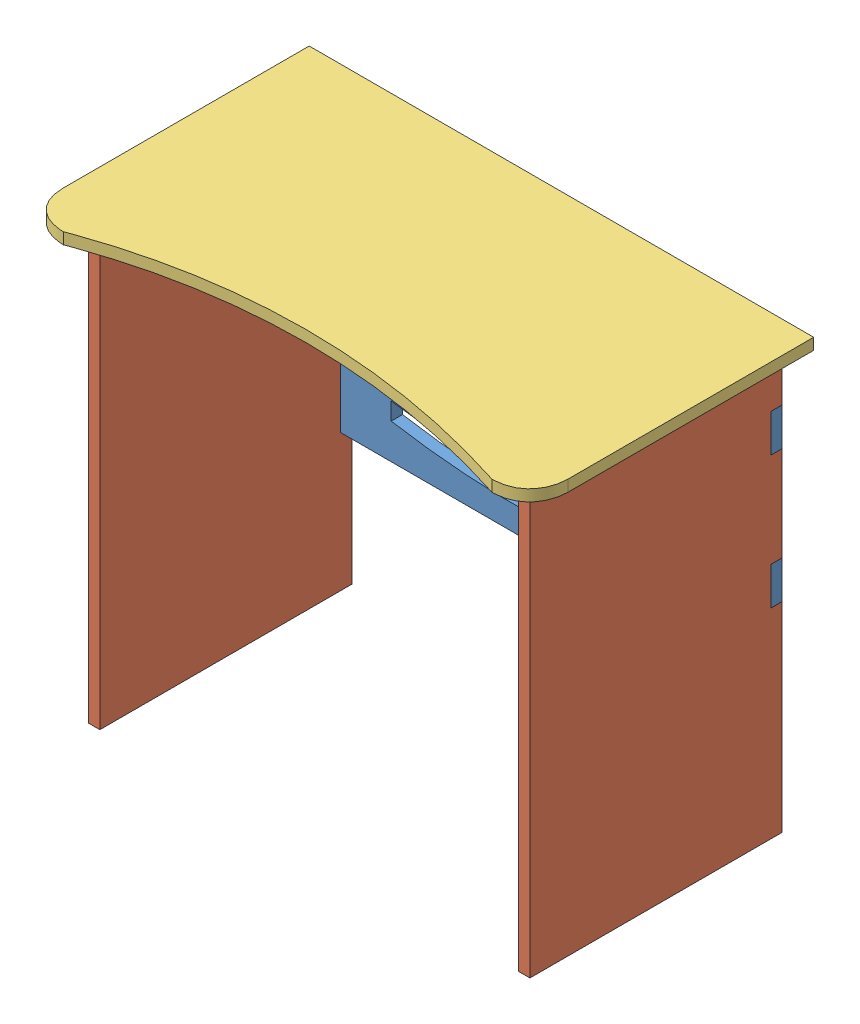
SolidWorks assembly Assem1.sldasm, configuration Default (file format 9000). Lengths in mm.
Overall size (800 705 450).
4 component instances, 3 part files, 3 mates.
Components (placement in the parent):
- FRONT-1: FRONT.SLDPRT [Default] at (201.6829 293.3144 608.6692) size (700 470 18)
- SIDE-1: SIDE.SLDPRT [Default] at (-148.3171 191.3144 808.6692) size (18 700 400)
- TOP-1: TOP.SLDPRT [Default] at (201.6829 528.3144 833.6692) size (800 18 450)
- SIDE-2: SIDE.SLDPRT [Default] at (533.6829 191.3144 808.6692) size (18 700 400)
Mates (geometry in assembly coordinates):
- Coincident1: coincident: point of TOP-1; point of SIDE-2
- Coincident2: coincident: point of SIDE-1; point of TOP-1
- Coincident3: coincident: point of FRONT-1; point of SIDE-2
